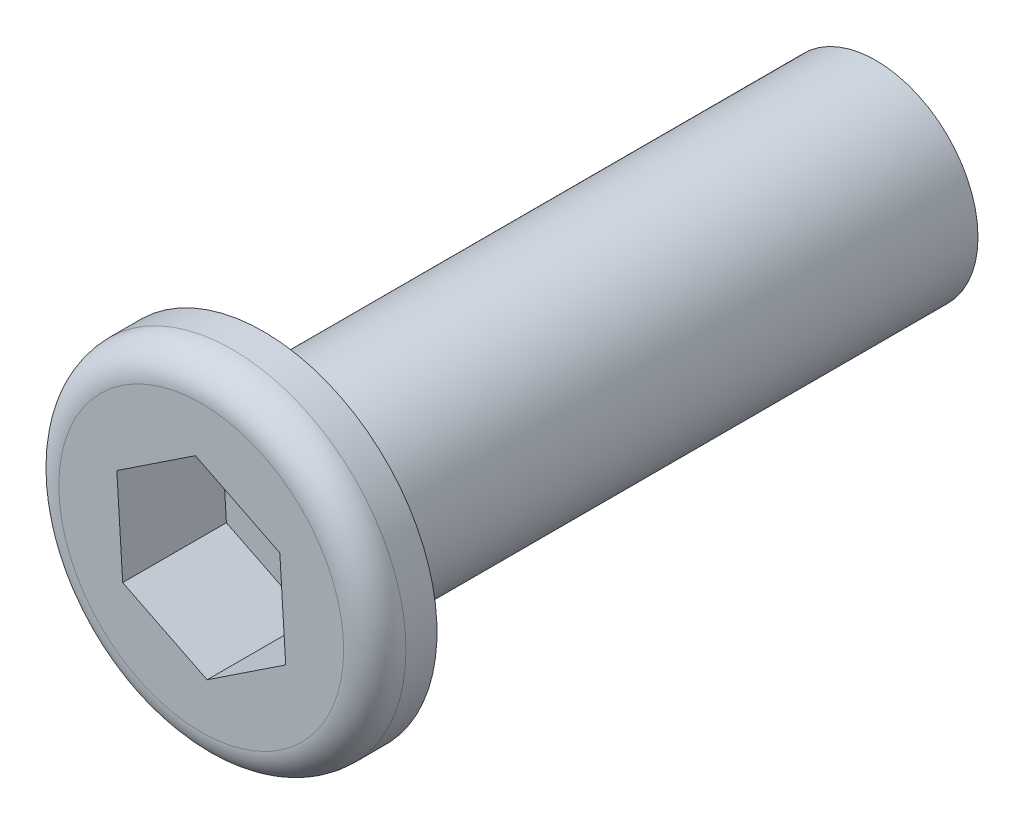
ISO-10303-21;
HEADER;
FILE_DESCRIPTION(('STEP AP214'),'2;1');
FILE_NAME('part.step','',(''),(''),'','','');
FILE_SCHEMA(('AUTOMOTIVE_DESIGN { 1 0 10303 214 1 1 1 1 }'));
ENDSEC;
DATA;
#1=APPLICATION_CONTEXT('core data for automotive mechanical design processes');
#2=APPLICATION_PROTOCOL_DEFINITION('international standard','automotive_design',2000,#1);
#3=PRODUCT_CONTEXT('',#1,'mechanical');
#4=PRODUCT('Part','Part','',(#3));
#5=PRODUCT_RELATED_PRODUCT_CATEGORY('part','',(#4));
#6=PRODUCT_DEFINITION_FORMATION('','',#4);
#7=PRODUCT_DEFINITION_CONTEXT('part definition',#1,'design');
#8=PRODUCT_DEFINITION('design','',#6,#7);
#9=PRODUCT_DEFINITION_SHAPE('','',#8);
#10=(LENGTH_UNIT() NAMED_UNIT(*) SI_UNIT(.MILLI.,.METRE.));
#11=(NAMED_UNIT(*) PLANE_ANGLE_UNIT() SI_UNIT($,.RADIAN.));
#12=(NAMED_UNIT(*) SI_UNIT($,.STERADIAN.) SOLID_ANGLE_UNIT());
#13=UNCERTAINTY_MEASURE_WITH_UNIT(LENGTH_MEASURE(1.E-05),#10,'distance_accuracy_value','');
#14=(GEOMETRIC_REPRESENTATION_CONTEXT(3) GLOBAL_UNCERTAINTY_ASSIGNED_CONTEXT((#13)) GLOBAL_UNIT_ASSIGNED_CONTEXT((#10,
#11,#12)) REPRESENTATION_CONTEXT('',''));
#15=CARTESIAN_POINT('',(0.,0.,0.));
#16=DIRECTION('',(0.,0.,1.));
#17=DIRECTION('',(1.,0.,0.));
#18=AXIS2_PLACEMENT_3D('',#15,#16,#17);
#19=CARTESIAN_POINT('',(0.,0.,15.));
#20=DIRECTION('',(0.,0.,-1.));
#21=DIRECTION('',(-1.,0.,0.));
#22=AXIS2_PLACEMENT_3D('',#19,#20,#21);
#23=CYLINDRICAL_SURFACE('',#22,2.5);
#24=CARTESIAN_POINT('',(0.,0.,15.));
#25=DIRECTION('',(0.,0.,1.));
#26=DIRECTION('',(1.,0.,0.));
#27=AXIS2_PLACEMENT_3D('',#24,#25,#26);
#28=CIRCLE('',#27,2.5);
#29=CARTESIAN_POINT('',(2.5,0.,15.));
#30=VERTEX_POINT('',#29);
#31=EDGE_CURVE('E142',#30,#30,#28,.T.);
#32=ORIENTED_EDGE('',*,*,#31,.F.);
#33=EDGE_LOOP('',(#32));
#34=FACE_BOUND('',#33,.T.);
#35=CARTESIAN_POINT('',(0.,0.,0.));
#36=DIRECTION('',(0.,0.,1.));
#37=DIRECTION('',(1.,0.,0.));
#38=AXIS2_PLACEMENT_3D('',#35,#36,#37);
#39=CIRCLE('',#38,2.5);
#40=CARTESIAN_POINT('',(2.5,0.,0.));
#41=VERTEX_POINT('',#40);
#42=EDGE_CURVE('E141',#41,#41,#39,.T.);
#43=ORIENTED_EDGE('',*,*,#42,.T.);
#44=EDGE_LOOP('',(#43));
#45=FACE_BOUND('',#44,.T.);
#46=ADVANCED_FACE('F31',(#34,#45),#23,.T.);
#47=CARTESIAN_POINT('',(0.,0.,0.));
#48=DIRECTION('',(0.,0.,1.));
#49=DIRECTION('',(1.,0.,0.));
#50=AXIS2_PLACEMENT_3D('',#47,#48,#49);
#51=PLANE('',#50);
#52=ORIENTED_EDGE('',*,*,#42,.F.);
#53=EDGE_LOOP('',(#52));
#54=FACE_BOUND('',#53,.T.);
#55=ADVANCED_FACE('F161',(#54),#51,.F.);
#56=CARTESIAN_POINT('',(0.,0.,15.));
#57=DIRECTION('',(0.,0.,1.));
#58=DIRECTION('',(1.,0.,0.));
#59=AXIS2_PLACEMENT_3D('',#56,#57,#58);
#60=PLANE('',#59);
#61=CARTESIAN_POINT('',(0.,0.,15.));
#62=DIRECTION('',(0.,0.,1.));
#63=DIRECTION('',(1.,0.,0.));
#64=AXIS2_PLACEMENT_3D('',#61,#62,#63);
#65=CIRCLE('',#64,4.25);
#66=CARTESIAN_POINT('',(-4.25,0.,15.));
#67=VERTEX_POINT('',#66);
#68=EDGE_CURVE('E133',#67,#67,#65,.T.);
#69=ORIENTED_EDGE('',*,*,#68,.F.);
#70=EDGE_LOOP('',(#69));
#71=FACE_BOUND('',#70,.T.);
#72=ORIENTED_EDGE('',*,*,#31,.T.);
#73=EDGE_LOOP('',(#72));
#74=FACE_BOUND('',#73,.T.);
#75=ADVANCED_FACE('F166',(#71,#74),#60,.F.);
#76=CARTESIAN_POINT('',(0.,0.,16.524));
#77=DIRECTION('',(0.,0.,-1.));
#78=DIRECTION('',(-1.,0.,0.));
#79=AXIS2_PLACEMENT_3D('',#76,#77,#78);
#80=CYLINDRICAL_SURFACE('',#79,4.25);
#81=CARTESIAN_POINT('',(0.,0.,15.762));
#82=DIRECTION('',(0.,0.,1.));
#83=DIRECTION('',(1.,0.,0.));
#84=AXIS2_PLACEMENT_3D('',#81,#82,#83);
#85=CIRCLE('',#84,4.25);
#86=CARTESIAN_POINT('',(-4.25,0.,15.762));
#87=VERTEX_POINT('',#86);
#88=EDGE_CURVE('E11',#87,#87,#85,.F.);
#89=CARTESIAN_POINT('',(-4.25,0.,15.762));
#90=CARTESIAN_POINT('',(-4.25,0.,15.7540625));
#91=CARTESIAN_POINT('',(-4.25,0.,15.746125));
#92=CARTESIAN_POINT('',(-4.25,0.,15.73025));
#93=CARTESIAN_POINT('',(-4.25,0.,15.7223125));
#94=CARTESIAN_POINT('',(-4.25,0.,15.7064375));
#95=CARTESIAN_POINT('',(-4.25,0.,15.6985));
#96=CARTESIAN_POINT('',(-4.25,0.,15.682625));
#97=CARTESIAN_POINT('',(-4.25,0.,15.6746875));
#98=CARTESIAN_POINT('',(-4.25,0.,15.6588125));
#99=CARTESIAN_POINT('',(-4.25,0.,15.650875));
#100=CARTESIAN_POINT('',(-4.25,0.,15.635));
#101=CARTESIAN_POINT('',(-4.25,0.,15.6270625));
#102=CARTESIAN_POINT('',(-4.25,0.,15.6111875));
#103=CARTESIAN_POINT('',(-4.25,0.,15.60325));
#104=CARTESIAN_POINT('',(-4.25,0.,15.587375));
#105=CARTESIAN_POINT('',(-4.25,0.,15.5794375));
#106=CARTESIAN_POINT('',(-4.25,0.,15.5635625));
#107=CARTESIAN_POINT('',(-4.25,0.,15.555625));
#108=CARTESIAN_POINT('',(-4.25,0.,15.53975));
#109=CARTESIAN_POINT('',(-4.25,0.,15.5318125));
#110=CARTESIAN_POINT('',(-4.25,0.,15.5159375));
#111=CARTESIAN_POINT('',(-4.25,0.,15.508));
#112=CARTESIAN_POINT('',(-4.25,0.,15.492125));
#113=CARTESIAN_POINT('',(-4.25,0.,15.4841875));
#114=CARTESIAN_POINT('',(-4.25,0.,15.4683125));
#115=CARTESIAN_POINT('',(-4.25,0.,15.460375));
#116=CARTESIAN_POINT('',(-4.25,0.,15.4445));
#117=CARTESIAN_POINT('',(-4.25,0.,15.4365625));
#118=CARTESIAN_POINT('',(-4.25,0.,15.4206875));
#119=CARTESIAN_POINT('',(-4.25,0.,15.41275));
#120=CARTESIAN_POINT('',(-4.25,0.,15.396875));
#121=CARTESIAN_POINT('',(-4.25,0.,15.3889375));
#122=CARTESIAN_POINT('',(-4.25,0.,15.3730625));
#123=CARTESIAN_POINT('',(-4.25,0.,15.365125));
#124=CARTESIAN_POINT('',(-4.25,0.,15.34925));
#125=CARTESIAN_POINT('',(-4.25,0.,15.3413125));
#126=CARTESIAN_POINT('',(-4.25,0.,15.3254375));
#127=CARTESIAN_POINT('',(-4.25,0.,15.3175));
#128=CARTESIAN_POINT('',(-4.25,0.,15.301625));
#129=CARTESIAN_POINT('',(-4.25,0.,15.2936875));
#130=CARTESIAN_POINT('',(-4.25,0.,15.2778125));
#131=CARTESIAN_POINT('',(-4.25,0.,15.269875));
#132=CARTESIAN_POINT('',(-4.25,0.,15.254));
#133=CARTESIAN_POINT('',(-4.25,0.,15.2460625));
#134=CARTESIAN_POINT('',(-4.25,0.,15.2301875));
#135=CARTESIAN_POINT('',(-4.25,0.,15.22225));
#136=CARTESIAN_POINT('',(-4.25,0.,15.206375));
#137=CARTESIAN_POINT('',(-4.25,0.,15.1984375));
#138=CARTESIAN_POINT('',(-4.25,0.,15.1825625));
#139=CARTESIAN_POINT('',(-4.25,0.,15.174625));
#140=CARTESIAN_POINT('',(-4.25,0.,15.15875));
#141=CARTESIAN_POINT('',(-4.25,0.,15.1508125));
#142=CARTESIAN_POINT('',(-4.25,0.,15.1349375));
#143=CARTESIAN_POINT('',(-4.25,0.,15.127));
#144=CARTESIAN_POINT('',(-4.25,0.,15.111125));
#145=CARTESIAN_POINT('',(-4.25,0.,15.1031875));
#146=CARTESIAN_POINT('',(-4.25,0.,15.0873125));
#147=CARTESIAN_POINT('',(-4.25,0.,15.079375));
#148=CARTESIAN_POINT('',(-4.25,0.,15.0635));
#149=CARTESIAN_POINT('',(-4.25,0.,15.0555625));
#150=CARTESIAN_POINT('',(-4.25,0.,15.0396875));
#151=CARTESIAN_POINT('',(-4.25,0.,15.03175));
#152=CARTESIAN_POINT('',(-4.25,0.,15.015875));
#153=CARTESIAN_POINT('',(-4.25,0.,15.0079375));
#154=CARTESIAN_POINT('',(-4.25,0.,15.));
#155=B_SPLINE_CURVE_WITH_KNOTS('',3,(#89,#90,#91,#92,#93,#94,#95,#96,#97,#98,#99,#100,#101,#102,
#103,#104,#105,#106,#107,#108,#109,#110,#111,#112,#113,#114,#115,#116,#117,#118,#119,#120,#121,
#122,#123,#124,#125,#126,#127,#128,#129,#130,#131,#132,#133,#134,#135,#136,#137,#138,#139,#140,
#141,#142,#143,#144,#145,#146,#147,#148,#149,#150,#151,#152,#153,#154),.UNSPECIFIED.,.F.,.F.,(4,
2,2,2,2,2,2,2,2,2,2,2,2,2,2,2,2,2,2,2,2,2,2,2,2,2,2,2,2,2,2,2,4),(0.,0.0238125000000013,
0.0476250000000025,0.0714375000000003,0.0952500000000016,0.119062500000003,0.142875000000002,
0.166687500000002,0.190500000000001,0.214312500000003,0.238125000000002,0.261937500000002,
0.285750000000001,0.309562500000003,0.333375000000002,0.357187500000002,0.381000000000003,
0.404812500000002,0.428625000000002,0.452437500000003,0.476250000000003,0.500062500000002,
0.523875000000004,0.547687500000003,0.571500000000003,0.595312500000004,0.619125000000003,
0.642937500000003,0.666750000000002,0.690562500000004,0.714375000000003,0.738187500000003,
0.762000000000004),.UNSPECIFIED.);
#156=EDGE_CURVE('BSEAM172',#87,#67,#155,.T.);
#157=ORIENTED_EDGE('',*,*,#88,.T.);
#158=ORIENTED_EDGE('',*,*,#68,.T.);
#159=ORIENTED_EDGE('',*,*,#156,.T.);
#160=ORIENTED_EDGE('',*,*,#156,.F.);
#161=EDGE_LOOP('',(#157,#159,#158,#160));
#162=FACE_BOUND('',#161,.T.);
#163=ADVANCED_FACE('F172',(#162),#80,.T.);
#164=CARTESIAN_POINT('',(0.,0.,16.524));
#165=DIRECTION('',(0.,0.,1.));
#166=DIRECTION('',(1.,0.,0.));
#167=AXIS2_PLACEMENT_3D('',#164,#165,#166);
#168=PLANE('',#167);
#169=CARTESIAN_POINT('',(0.,0.,16.524));
#170=DIRECTION('',(0.,0.,1.));
#171=DIRECTION('',(1.,0.,0.));
#172=AXIS2_PLACEMENT_3D('',#169,#170,#171);
#173=CIRCLE('',#172,3.488);
#174=CARTESIAN_POINT('',(3.488,0.,16.524));
#175=VERTEX_POINT('',#174);
#176=EDGE_CURVE('E39',#175,#175,#173,.T.);
#177=ORIENTED_EDGE('',*,*,#176,.T.);
#178=EDGE_LOOP('',(#177));
#179=FACE_BOUND('',#178,.T.);
#180=DIRECTION('',(0.833193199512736,0.552981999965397,0.));
#181=VECTOR('',#180,1.);
#182=CARTESIAN_POINT('',(0.143875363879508,-2.30491501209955,16.524));
#183=LINE('',#182,#181);
#184=CARTESIAN_POINT('',(0.143875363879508,-2.30491501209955,16.524));
#185=VERTEX_POINT('',#184);
#186=CARTESIAN_POINT('',(2.06805263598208,-1.02785778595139,16.524));
#187=VERTEX_POINT('',#186);
#188=EDGE_CURVE('E46',#185,#187,#183,.T.);
#189=ORIENTED_EDGE('',*,*,#188,.F.);
#190=DIRECTION('',(0.895493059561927,-0.445075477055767,0.));
#191=VECTOR('',#190,1.);
#192=CARTESIAN_POINT('',(-1.92417727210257,-1.27705722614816,16.524));
#193=LINE('',#192,#191);
#194=CARTESIAN_POINT('',(-1.92417727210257,-1.27705722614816,16.524));
#195=VERTEX_POINT('',#194);
#196=EDGE_CURVE('E129',#195,#185,#193,.T.);
#197=ORIENTED_EDGE('',*,*,#196,.F.);
#198=DIRECTION('',(0.062299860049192,-0.998057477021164,0.));
#199=VECTOR('',#198,1.);
#200=CARTESIAN_POINT('',(-2.06805263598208,1.02785778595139,16.524));
#201=LINE('',#200,#199);
#202=CARTESIAN_POINT('',(-2.06805263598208,1.02785778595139,16.524));
#203=VERTEX_POINT('',#202);
#204=EDGE_CURVE('E127',#203,#195,#201,.T.);
#205=ORIENTED_EDGE('',*,*,#204,.F.);
#206=DIRECTION('',(-0.833193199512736,-0.552981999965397,0.));
#207=VECTOR('',#206,1.);
#208=CARTESIAN_POINT('',(-0.143875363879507,2.30491501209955,16.524));
#209=LINE('',#208,#207);
#210=CARTESIAN_POINT('',(-0.143875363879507,2.30491501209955,16.524));
#211=VERTEX_POINT('',#210);
#212=EDGE_CURVE('E94',#211,#203,#209,.T.);
#213=ORIENTED_EDGE('',*,*,#212,.F.);
#214=DIRECTION('',(-0.895493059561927,0.445075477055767,0.));
#215=VECTOR('',#214,1.);
#216=CARTESIAN_POINT('',(1.92417727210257,1.27705722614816,16.524));
#217=LINE('',#216,#215);
#218=CARTESIAN_POINT('',(1.92417727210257,1.27705722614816,16.524));
#219=VERTEX_POINT('',#218);
#220=EDGE_CURVE('E123',#219,#211,#217,.T.);
#221=ORIENTED_EDGE('',*,*,#220,.F.);
#222=DIRECTION('',(-0.0622998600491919,0.998057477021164,0.));
#223=VECTOR('',#222,1.);
#224=CARTESIAN_POINT('',(2.06805263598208,-1.02785778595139,16.524));
#225=LINE('',#224,#223);
#226=EDGE_CURVE('E120',#187,#219,#225,.T.);
#227=ORIENTED_EDGE('',*,*,#226,.F.);
#228=EDGE_LOOP('',(#189,#197,#205,#213,#221,#227));
#229=FACE_BOUND('',#228,.T.);
#230=ADVANCED_FACE('F149',(#179,#229),#168,.T.);
#231=CARTESIAN_POINT('',(0.143875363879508,-2.30491501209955,13.984));
#232=DIRECTION('',(0.552981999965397,-0.833193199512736,0.));
#233=DIRECTION('',(0.833193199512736,0.552981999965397,0.));
#234=AXIS2_PLACEMENT_3D('',#231,#232,#233);
#235=PLANE('',#234);
#236=ORIENTED_EDGE('',*,*,#188,.T.);
#237=DIRECTION('',(0.,0.,1.));
#238=VECTOR('',#237,1.);
#239=CARTESIAN_POINT('',(2.06805263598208,-1.02785778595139,13.984));
#240=LINE('',#239,#238);
#241=CARTESIAN_POINT('',(2.06805263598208,-1.02785778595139,13.984));
#242=VERTEX_POINT('',#241);
#243=EDGE_CURVE('E76',#242,#187,#240,.T.);
#244=ORIENTED_EDGE('',*,*,#243,.F.);
#245=DIRECTION('',(0.833193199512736,0.552981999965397,0.));
#246=VECTOR('',#245,1.);
#247=CARTESIAN_POINT('',(0.143875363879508,-2.30491501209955,13.984));
#248=LINE('',#247,#246);
#249=CARTESIAN_POINT('',(0.143875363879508,-2.30491501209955,13.984));
#250=VERTEX_POINT('',#249);
#251=EDGE_CURVE('E131',#250,#242,#248,.T.);
#252=ORIENTED_EDGE('',*,*,#251,.F.);
#253=DIRECTION('',(0.,0.,1.));
#254=VECTOR('',#253,1.);
#255=CARTESIAN_POINT('',(0.143875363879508,-2.30491501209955,13.984));
#256=LINE('',#255,#254);
#257=EDGE_CURVE('E54',#250,#185,#256,.T.);
#258=ORIENTED_EDGE('',*,*,#257,.T.);
#259=EDGE_LOOP('',(#236,#244,#252,#258));
#260=FACE_BOUND('',#259,.T.);
#261=ADVANCED_FACE('F181',(#260),#235,.F.);
#262=CARTESIAN_POINT('',(-1.92417727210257,-1.27705722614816,13.984));
#263=DIRECTION('',(-0.445075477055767,-0.895493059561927,0.));
#264=DIRECTION('',(0.895493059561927,-0.445075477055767,0.));
#265=AXIS2_PLACEMENT_3D('',#262,#263,#264);
#266=PLANE('',#265);
#267=ORIENTED_EDGE('',*,*,#196,.T.);
#268=ORIENTED_EDGE('',*,*,#257,.F.);
#269=DIRECTION('',(0.895493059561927,-0.445075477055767,0.));
#270=VECTOR('',#269,1.);
#271=CARTESIAN_POINT('',(-1.92417727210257,-1.27705722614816,13.984));
#272=LINE('',#271,#270);
#273=CARTESIAN_POINT('',(-1.92417727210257,-1.27705722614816,13.984));
#274=VERTEX_POINT('',#273);
#275=EDGE_CURVE('E106',#274,#250,#272,.T.);
#276=ORIENTED_EDGE('',*,*,#275,.F.);
#277=DIRECTION('',(0.,0.,1.));
#278=VECTOR('',#277,1.);
#279=CARTESIAN_POINT('',(-1.92417727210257,-1.27705722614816,13.984));
#280=LINE('',#279,#278);
#281=EDGE_CURVE('E98',#274,#195,#280,.T.);
#282=ORIENTED_EDGE('',*,*,#281,.T.);
#283=EDGE_LOOP('',(#267,#268,#276,#282));
#284=FACE_BOUND('',#283,.T.);
#285=ADVANCED_FACE('F184',(#284),#266,.F.);
#286=CARTESIAN_POINT('',(-2.06805263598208,1.02785778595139,13.984));
#287=DIRECTION('',(-0.998057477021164,-0.062299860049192,0.));
#288=DIRECTION('',(0.062299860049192,-0.998057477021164,0.));
#289=AXIS2_PLACEMENT_3D('',#286,#287,#288);
#290=PLANE('',#289);
#291=ORIENTED_EDGE('',*,*,#204,.T.);
#292=ORIENTED_EDGE('',*,*,#281,.F.);
#293=DIRECTION('',(0.062299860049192,-0.998057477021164,0.));
#294=VECTOR('',#293,1.);
#295=CARTESIAN_POINT('',(-2.06805263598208,1.02785778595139,13.984));
#296=LINE('',#295,#294);
#297=CARTESIAN_POINT('',(-2.06805263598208,1.02785778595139,13.984));
#298=VERTEX_POINT('',#297);
#299=EDGE_CURVE('E102',#298,#274,#296,.T.);
#300=ORIENTED_EDGE('',*,*,#299,.F.);
#301=DIRECTION('',(0.,0.,1.));
#302=VECTOR('',#301,1.);
#303=CARTESIAN_POINT('',(-2.06805263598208,1.02785778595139,13.984));
#304=LINE('',#303,#302);
#305=EDGE_CURVE('E87',#298,#203,#304,.T.);
#306=ORIENTED_EDGE('',*,*,#305,.T.);
#307=EDGE_LOOP('',(#291,#292,#300,#306));
#308=FACE_BOUND('',#307,.T.);
#309=ADVANCED_FACE('F103',(#308),#290,.F.);
#310=CARTESIAN_POINT('',(-0.143875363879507,2.30491501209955,13.984));
#311=DIRECTION('',(-0.552981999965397,0.833193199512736,0.));
#312=DIRECTION('',(-0.833193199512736,-0.552981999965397,0.));
#313=AXIS2_PLACEMENT_3D('',#310,#311,#312);
#314=PLANE('',#313);
#315=ORIENTED_EDGE('',*,*,#212,.T.);
#316=ORIENTED_EDGE('',*,*,#305,.F.);
#317=DIRECTION('',(-0.833193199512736,-0.552981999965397,0.));
#318=VECTOR('',#317,1.);
#319=CARTESIAN_POINT('',(-0.143875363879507,2.30491501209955,13.984));
#320=LINE('',#319,#318);
#321=CARTESIAN_POINT('',(-0.143875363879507,2.30491501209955,13.984));
#322=VERTEX_POINT('',#321);
#323=EDGE_CURVE('E91',#322,#298,#320,.T.);
#324=ORIENTED_EDGE('',*,*,#323,.F.);
#325=DIRECTION('',(0.,0.,1.));
#326=VECTOR('',#325,1.);
#327=CARTESIAN_POINT('',(-0.143875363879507,2.30491501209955,13.984));
#328=LINE('',#327,#326);
#329=EDGE_CURVE('E99',#322,#211,#328,.T.);
#330=ORIENTED_EDGE('',*,*,#329,.T.);
#331=EDGE_LOOP('',(#315,#316,#324,#330));
#332=FACE_BOUND('',#331,.T.);
#333=ADVANCED_FACE('F89',(#332),#314,.F.);
#334=CARTESIAN_POINT('',(1.92417727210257,1.27705722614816,13.984));
#335=DIRECTION('',(0.445075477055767,0.895493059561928,0.));
#336=DIRECTION('',(-0.895493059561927,0.445075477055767,0.));
#337=AXIS2_PLACEMENT_3D('',#334,#335,#336);
#338=PLANE('',#337);
#339=ORIENTED_EDGE('',*,*,#220,.T.);
#340=ORIENTED_EDGE('',*,*,#329,.F.);
#341=DIRECTION('',(-0.895493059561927,0.445075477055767,0.));
#342=VECTOR('',#341,1.);
#343=CARTESIAN_POINT('',(1.92417727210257,1.27705722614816,13.984));
#344=LINE('',#343,#342);
#345=CARTESIAN_POINT('',(1.92417727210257,1.27705722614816,13.984));
#346=VERTEX_POINT('',#345);
#347=EDGE_CURVE('E112',#346,#322,#344,.T.);
#348=ORIENTED_EDGE('',*,*,#347,.F.);
#349=DIRECTION('',(0.,0.,1.));
#350=VECTOR('',#349,1.);
#351=CARTESIAN_POINT('',(1.92417727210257,1.27705722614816,13.984));
#352=LINE('',#351,#350);
#353=EDGE_CURVE('E136',#346,#219,#352,.T.);
#354=ORIENTED_EDGE('',*,*,#353,.T.);
#355=EDGE_LOOP('',(#339,#340,#348,#354));
#356=FACE_BOUND('',#355,.T.);
#357=ADVANCED_FACE('F187',(#356),#338,.F.);
#358=CARTESIAN_POINT('',(2.06805263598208,-1.02785778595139,13.984));
#359=DIRECTION('',(0.998057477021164,0.0622998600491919,0.));
#360=DIRECTION('',(-0.0622998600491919,0.998057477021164,0.));
#361=AXIS2_PLACEMENT_3D('',#358,#359,#360);
#362=PLANE('',#361);
#363=ORIENTED_EDGE('',*,*,#226,.T.);
#364=ORIENTED_EDGE('',*,*,#353,.F.);
#365=DIRECTION('',(-0.0622998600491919,0.998057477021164,0.));
#366=VECTOR('',#365,1.);
#367=CARTESIAN_POINT('',(2.06805263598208,-1.02785778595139,13.984));
#368=LINE('',#367,#366);
#369=EDGE_CURVE('E114',#242,#346,#368,.T.);
#370=ORIENTED_EDGE('',*,*,#369,.F.);
#371=ORIENTED_EDGE('',*,*,#243,.T.);
#372=EDGE_LOOP('',(#363,#364,#370,#371));
#373=FACE_BOUND('',#372,.T.);
#374=ADVANCED_FACE('F157',(#373),#362,.F.);
#375=CARTESIAN_POINT('',(2.06805263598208,-1.02785778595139,13.984));
#376=DIRECTION('',(0.,0.,1.));
#377=DIRECTION('',(1.,0.,0.));
#378=AXIS2_PLACEMENT_3D('',#375,#376,#377);
#379=PLANE('',#378);
#380=ORIENTED_EDGE('',*,*,#251,.T.);
#381=ORIENTED_EDGE('',*,*,#369,.T.);
#382=ORIENTED_EDGE('',*,*,#347,.T.);
#383=ORIENTED_EDGE('',*,*,#323,.T.);
#384=ORIENTED_EDGE('',*,*,#299,.T.);
#385=ORIENTED_EDGE('',*,*,#275,.T.);
#386=EDGE_LOOP('',(#380,#381,#382,#383,#384,#385));
#387=FACE_BOUND('',#386,.T.);
#388=ADVANCED_FACE('F109',(#387),#379,.T.);
#389=CARTESIAN_POINT('',(0.,0.,15.762));
#390=DIRECTION('',(0.,0.,1.));
#391=DIRECTION('',(1.,0.,0.));
#392=AXIS2_PLACEMENT_3D('',#389,#390,#391);
#393=TOROIDAL_SURFACE('',#392,3.488,0.762);
#394=ORIENTED_EDGE('',*,*,#88,.F.);
#395=EDGE_LOOP('',(#394));
#396=FACE_BOUND('',#395,.T.);
#397=ORIENTED_EDGE('',*,*,#176,.F.);
#398=EDGE_LOOP('',(#397));
#399=FACE_BOUND('',#398,.T.);
#400=ADVANCED_FACE('F33',(#396,#399),#393,.T.);
#401=CLOSED_SHELL('',(#46,#55,#75,#163,#230,#261,#285,#309,#333,#357,#374,#388,#400));
#402=MANIFOLD_SOLID_BREP('B2',#401);
#403=ADVANCED_BREP_SHAPE_REPRESENTATION('',(#18,#402),#14);
#404=SHAPE_DEFINITION_REPRESENTATION(#9,#403);
ENDSEC;
END-ISO-10303-21;
